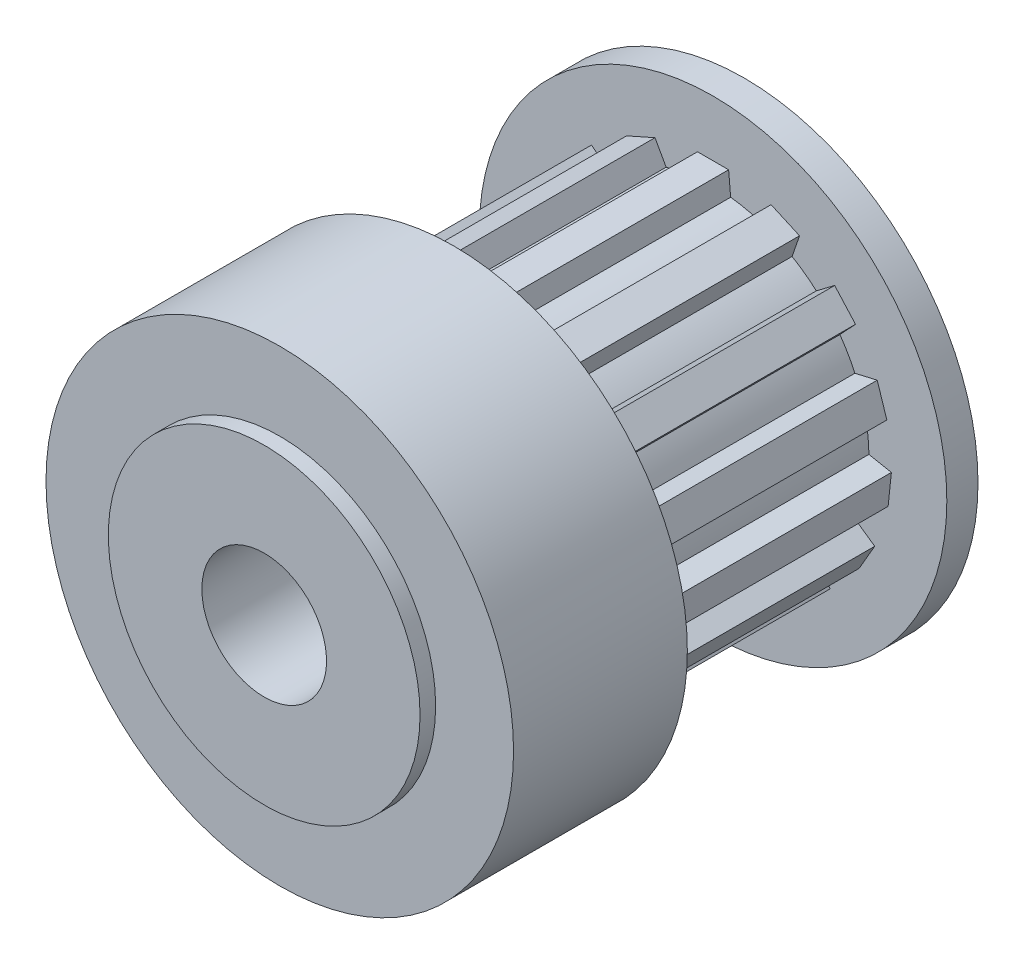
from build123d import *

# Parameters (mm, degrees)
SKETCH6_R                 = 2
BORE_DEPTH                = 20.19635382
SKETCH7_OUTSIDE_W         = 22.314
SKETCH7_OUTSIDE_H         = 22.314
SKETCH7_OUTSIDE_R         = 5
CUT_EXTRUDE3_DEPTH        = 0.6
EXTRUDE1_DEPTH            = 8.1
CIRPATTERN1_COUNT         = 15
CHAMFER1_SIZE             = 1.6
CHAMFER1_SIZE2            = 0.224865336
SKETCH13_OUTSIDE_W        = 22.314
SKETCH13_OUTSIDE_H        = 22.314
SKETCH13_OUTSIDE_R        = 5
CUT_EXTRUDE9_DEPTH        = 0.5
F_4_40_TAPPED_HOLE1_D     = 2.2606
F_4_40_TAPPED_HOLE1_DEPTH = 8.865
F_4_40_TAPPED_HOLE1_TIP   = 0.679152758


with BuildPart() as part:
    # Sketch2 → Revolve1 (revolve)
    with BuildSketch(Plane(origin=(0, 0, 0), x_dir=(1, 0, 0), z_dir=(0, 1, 0))):
        Polygon((0, 0), (0, 16), (7.5, 16), (7.5, 14.4), (5, 14.4), (5, 6.3), (7.5, 6.3), (7.5, 0), align=None)
    revolve(axis=Axis((0, 0, 0), (0, 0, -1)))

    # Sketch6 → Bore (cut, through all)
    with BuildSketch(Plane(origin=(0, 0, -16), x_dir=(-1, 0, 0), z_dir=(0, 0, -1))):
        Circle(SKETCH6_R)
    extrude(amount=-BORE_DEPTH, mode=Mode.SUBTRACT)

    # Sketch7 outside → Cut-Extrude3 (cut)
    with BuildSketch(Plane(origin=(0, 0, -16), x_dir=(-1, 0, 0), z_dir=(0, 0, -1))):
        Rectangle(SKETCH7_OUTSIDE_W, SKETCH7_OUTSIDE_H)
        with Locations(Location((0, 0, 0), (0, 0, 180))):
            Circle(SKETCH7_OUTSIDE_R, mode=Mode.SUBTRACT)
    extrude(amount=-CUT_EXTRUDE3_DEPTH, mode=Mode.SUBTRACT)

    # Sketch10 → Extrude1 (add)
    with BuildSketch(Plane(origin=(0, 0, -6.3), x_dir=(-1, 0, 0), z_dir=(0, 0, -1))):
        with BuildLine():
            Line((-0.5, 5.7), (0.5, 5.7))
            Line((0.5, 5.7), (0.564034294, 4.968084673))
            ThreePointArc((0.564034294, 4.968084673), (0, 5), (-0.564034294, 4.968084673))
            Line((-0.564034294, 4.968084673), (-0.5, 5.7))
        make_face()
    extrude1 = extrude(amount=EXTRUDE1_DEPTH)

    # CirPattern1: Extrude1 ×15 about axis
    cirpattern1_axis = Axis((0, 0, 0), (0, 0, 1))
    for i in range(1, CIRPATTERN1_COUNT):
        add(extrude1.rotate(cirpattern1_axis, i * 360 / CIRPATTERN1_COUNT))

    # Chamfer1
    chamfer1_edges = [part.edges().sort_by_distance(p)[0] for p in [
        (-7.5, 0, -6.3),
    ]]
    chamfer1_side = [part.faces().sort_by_distance(p)[0] for p in [
        (-7.287867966, 0, -6.3),
    ]]
    chamfer(chamfer1_edges, length=CHAMFER1_SIZE, length2=CHAMFER1_SIZE2, reference=chamfer1_side[0])

    # Sketch13 outside → Cut-Extrude9 (cut)
    with BuildSketch(Plane.XY):
        Rectangle(SKETCH13_OUTSIDE_W, SKETCH13_OUTSIDE_H)
        with Locations(Location((0, 0, 0), (0, 0, 180))):
            Circle(SKETCH13_OUTSIDE_R, mode=Mode.SUBTRACT)
    extrude(amount=-CUT_EXTRUDE9_DEPTH, mode=Mode.SUBTRACT)

    # 4-40 Tapped Hole1
    with Locations(Plane(origin=(-7.5, 0, -3.287567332), x_dir=(0, -1, 0), z_dir=(-1, 0, 0))):
        with Locations((0, -0.212432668)):
            Hole(F_4_40_TAPPED_HOLE1_D / 2, depth=F_4_40_TAPPED_HOLE1_DEPTH)
            with Locations((0, 0, -(F_4_40_TAPPED_HOLE1_DEPTH + F_4_40_TAPPED_HOLE1_TIP / 2))):  # 118° drill point
                Cone(0, F_4_40_TAPPED_HOLE1_D / 2, F_4_40_TAPPED_HOLE1_TIP, mode=Mode.SUBTRACT)


solid = part.part
